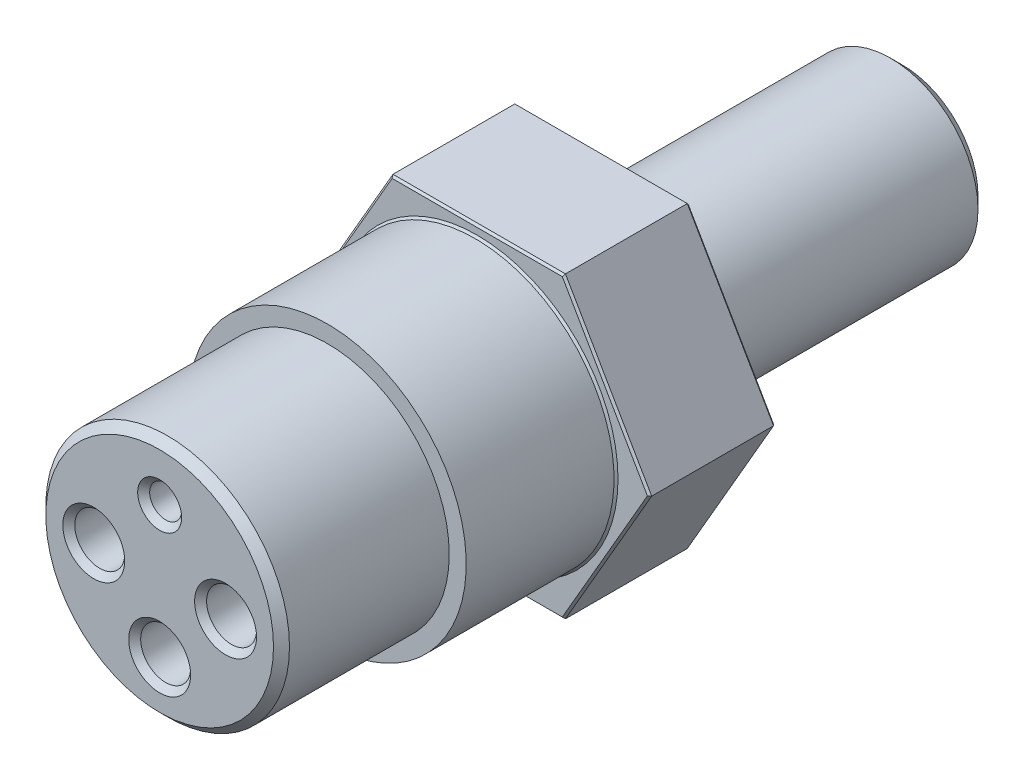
from build123d import *

# Parameters (mm, degrees)
SKETCH1_R      = 5.55625
POST_DEPTH     = 19.05
CHAMFER1_SIZE  = 0.762
HEX_2_DEPTH    = 8.001
SKETCH5_R      = 8.8265
EXTRUDE1_DEPTH = 9.525
CHAMFER2_SIZE  = 0.127
SKETCH3_R      = 7.747
RUBBER_DEPTH   = 10.668
CHAMFER3_SIZE  = 0.508
SKETCH4_R      = 1.5875
SKETCH4_R_2    = 1.016
SOCKETS_DEPTH  = 6.35
CHAMFER4_SIZE  = 0.381


with BuildPart() as part:
    # Sketch1 → post (new body)
    with BuildSketch(Plane.XY):
        Circle(SKETCH1_R)
    extrude(amount=-POST_DEPTH)

    # Chamfer1
    chamfer1_edges = [part.edges().sort_by_distance(p)[0] for p in [
        (-5.55625, 0, -19.05),
    ]]
    chamfer(chamfer1_edges, length=CHAMFER1_SIZE)

    # Sketch2 → hex 2 (add)
    with BuildSketch(Plane.XY):
        Polygon((-5.484596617, 9.4996), (-10.969193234, 0), (-5.484596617, -9.4996), (5.484596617, -9.4996), (10.969193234, 0), (5.484596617, 9.4996), align=None)
    extrude(amount=HEX_2_DEPTH)

    # Sketch5 → Extrude1 (add)
    with BuildSketch(Plane.XY.offset(8.001)):
        with Locations(Location((0, 0, 0), (0, 0, 180))):
            Circle(SKETCH5_R)
    extrude(amount=EXTRUDE1_DEPTH)

    # Chamfer2
    chamfer2_edges = [part.edges().sort_by_distance(p)[0] for p in [
        (8.226894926, 4.7498, 0),
        (0, 9.4996, 8.001),
        (-8.226894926, 4.7498, 8.001),
        (-8.226894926, -4.7498, 8.001),
        (0, -9.4996, 8.001),
        (8.226894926, -4.7498, 8.001),
        (8.226894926, 4.7498, 8.001),
        (8.8265, 0, 8.001),
        (0, 9.4996, 0),
        (-8.226894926, -4.7498, 0),
        (0, -9.4996, 0),
        (8.226894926, -4.7498, 0),
    ]]
    chamfer(chamfer2_edges, length=CHAMFER2_SIZE)

    # Sketch3 → rubber (add)
    with BuildSketch(Plane.XY.offset(17.526)):
        Circle(SKETCH3_R)
    extrude(amount=RUBBER_DEPTH)

    # Chamfer3
    chamfer3_edges = [part.edges().sort_by_distance(p)[0] for p in [
        (-7.747, 0, 28.194),
    ]]
    chamfer(chamfer3_edges, length=CHAMFER3_SIZE)

    # Sketch4 → sockets (cut)
    with BuildSketch(Plane.XY.offset(28.194)):
        with Locations((0, -4.191)):
            Circle(SKETCH4_R)
        with Locations((0, 4.191)):
            Circle(SKETCH4_R_2)
        with Locations((-4.191, 0)):
            Circle(SKETCH4_R)
        with Locations((4.191, 0)):
            Circle(SKETCH4_R)
    extrude(amount=-SOCKETS_DEPTH, mode=Mode.SUBTRACT)

    # Chamfer4
    chamfer4_edges = [part.edges().sort_by_distance(p)[0] for p in [
        (-1.5875, -4.191, 28.194),
        (-1.016, 4.191, 28.194),
        (-5.7785, 0, 28.194),
        (2.6035, 0, 28.194),
    ]]
    chamfer(chamfer4_edges, length=CHAMFER4_SIZE)


solid = part.part
